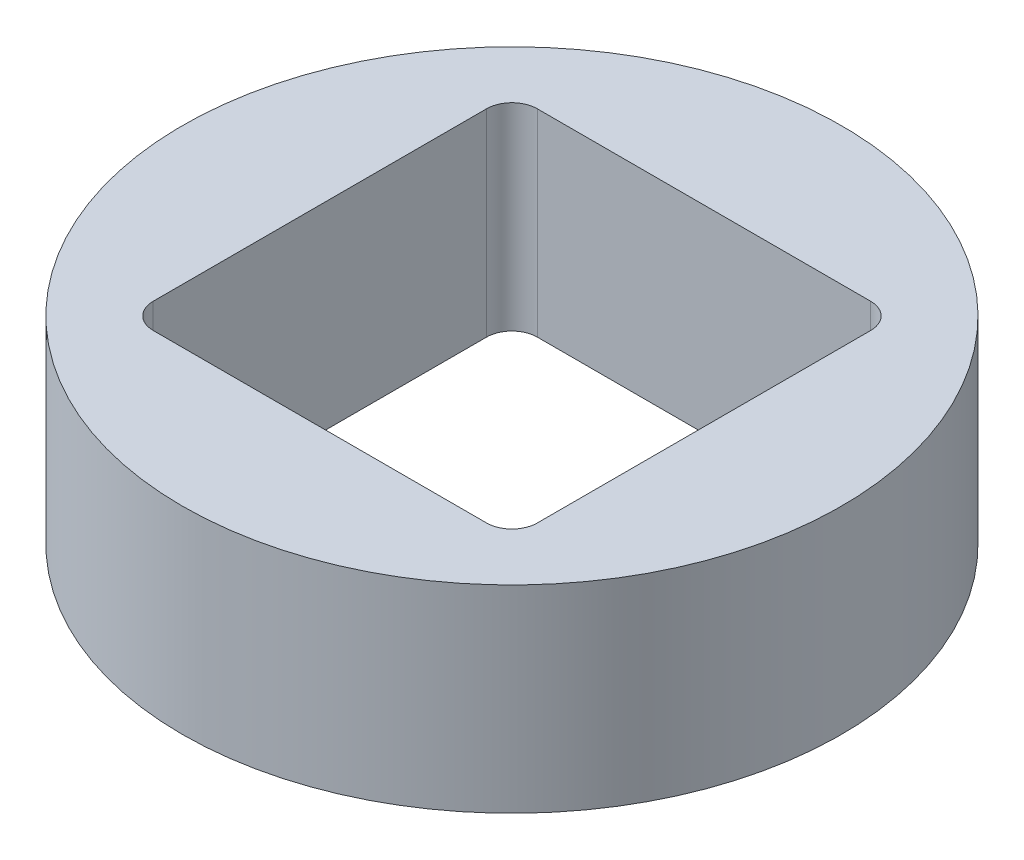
from build123d import *

# Parameters (mm, degrees)
SKETCH1_R           = 26
BOSS_EXTRUDE1_DEPTH = 15.6


with BuildPart() as part:
    # Sketch1 → Boss-Extrude1 (new body)
    with BuildSketch(Plane(origin=(0, 0, 0), x_dir=(1, 0, 0), z_dir=(0, 1, 0))):
        with Locations(Location((0, 0, 0), (0, 0, 270))):
            Circle(SKETCH1_R)
        with BuildLine():
            Line((13.15, -15.15), (-13.15, -15.15))
            ThreePointArc((-13.15, -15.15), (-14.564213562, -14.564213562), (-15.15, -13.15))
            Line((-15.15, -13.15), (-15.15, 13.15))
            ThreePointArc((-15.15, 13.15), (-14.564213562, 14.564213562), (-13.15, 15.15))
            Line((-13.15, 15.15), (13.15, 15.15))
            ThreePointArc((13.15, 15.15), (14.564213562, 14.564213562), (15.15, 13.15))
            Line((15.15, 13.15), (15.15, -13.15))
            ThreePointArc((15.15, -13.15), (14.564213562, -14.564213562), (13.15, -15.15))
        make_face(mode=Mode.SUBTRACT)
    extrude(amount=BOSS_EXTRUDE1_DEPTH)


solid = part.part
